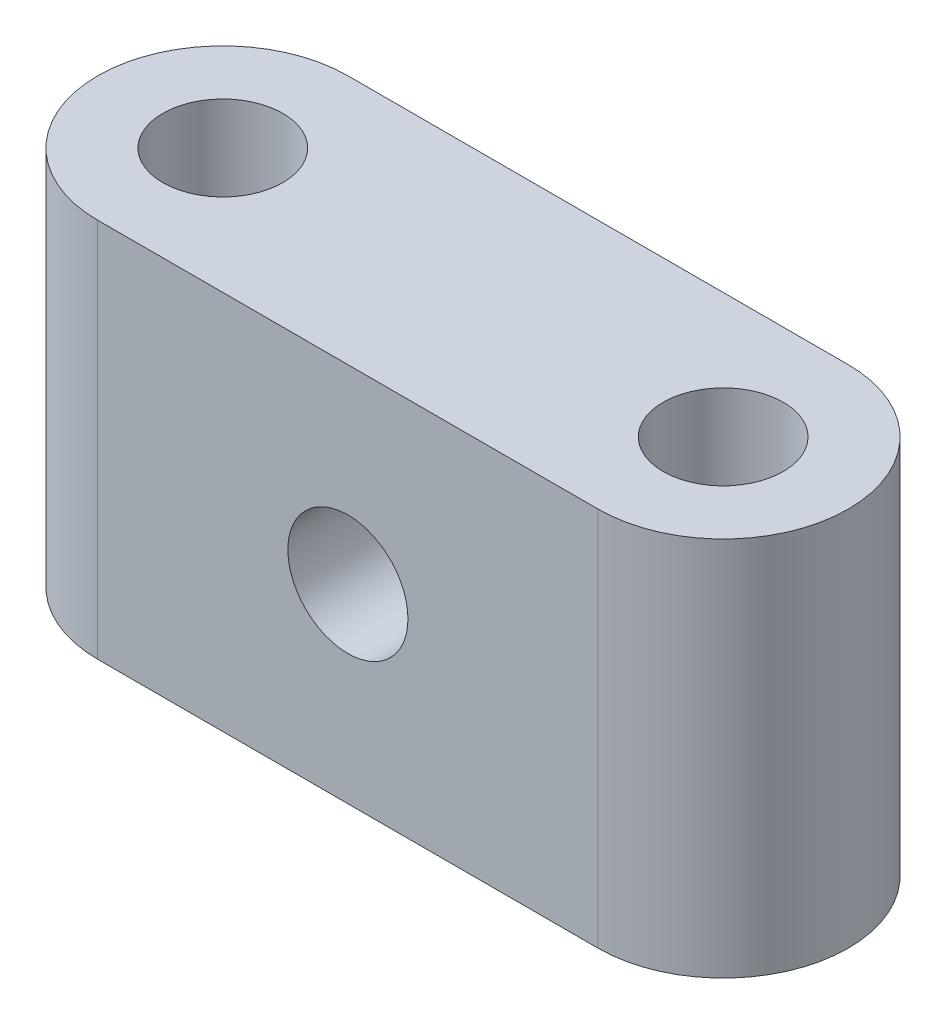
from build123d import *

# Parameters (mm, degrees)
SKETCH1_R           = 6
BOSS_EXTRUDE1_DEPTH = 38
SKETCH2_R           = 6
CUT_EXTRUDE1_DEPTH  = 12.5


with BuildPart() as part:
    # Sketch1 → Boss-Extrude1 (new body)
    with BuildSketch(Plane(origin=(0, 0, 0), x_dir=(1, 0, 0), z_dir=(0, 1, 0))):
        with BuildLine():
            Line((0, 12.5), (50, 12.5))
            ThreePointArc((50, 12.5), (62.5, 0), (50, -12.5))
            Line((50, -12.5), (0, -12.5))
            ThreePointArc((0, -12.5), (-12.5, 0), (0, 12.5))
        make_face()
        with Locations(Location((0, 0, 0), (0, 0, 270))):
            Circle(SKETCH1_R, mode=Mode.SUBTRACT)
        with Locations(Location((50, 0, 0), (0, 0, 270))):
            Circle(SKETCH1_R, mode=Mode.SUBTRACT)
    extrude(amount=BOSS_EXTRUDE1_DEPTH)

    # Sketch2 → Cut-Extrude1 (cut)
    with BuildSketch(Plane.XY.offset(12.5)):
        with Locations((25, 19)):
            Circle(SKETCH2_R)
    extrude(amount=-CUT_EXTRUDE1_DEPTH, mode=Mode.SUBTRACT)


solid = part.part
